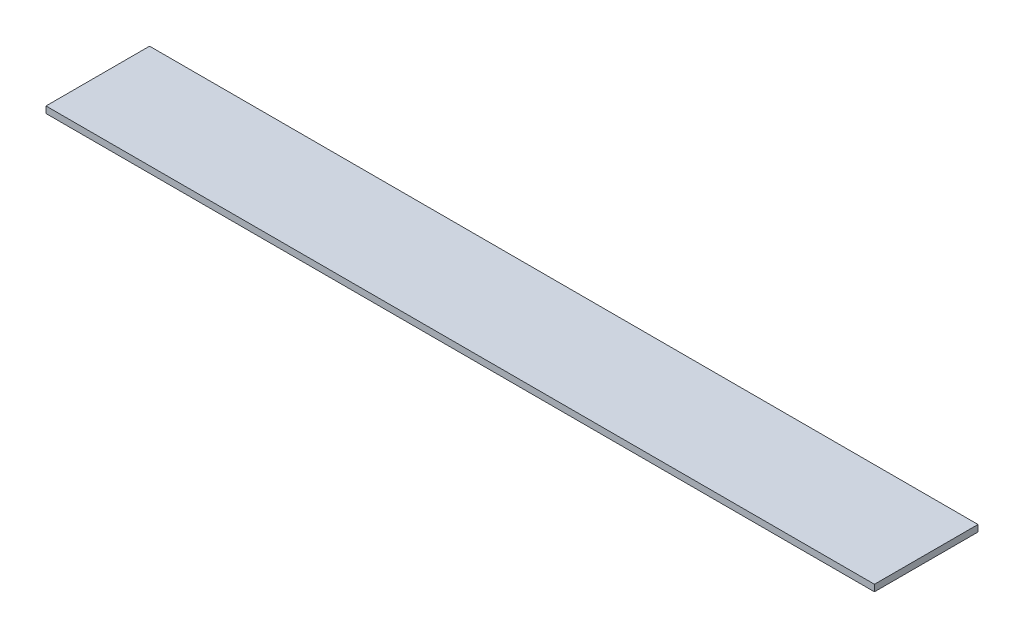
ISO-10303-21;
HEADER;
FILE_DESCRIPTION(('STEP AP214'),'2;1');
FILE_NAME('part.step','',(''),(''),'','','');
FILE_SCHEMA(('AUTOMOTIVE_DESIGN { 1 0 10303 214 1 1 1 1 }'));
ENDSEC;
DATA;
#1=APPLICATION_CONTEXT('core data for automotive mechanical design processes');
#2=APPLICATION_PROTOCOL_DEFINITION('international standard','automotive_design',2000,#1);
#3=PRODUCT_CONTEXT('',#1,'mechanical');
#4=PRODUCT('Part','Part','',(#3));
#5=PRODUCT_RELATED_PRODUCT_CATEGORY('part','',(#4));
#6=PRODUCT_DEFINITION_FORMATION('','',#4);
#7=PRODUCT_DEFINITION_CONTEXT('part definition',#1,'design');
#8=PRODUCT_DEFINITION('design','',#6,#7);
#9=PRODUCT_DEFINITION_SHAPE('','',#8);
#10=(LENGTH_UNIT() NAMED_UNIT(*) SI_UNIT(.MILLI.,.METRE.));
#11=(NAMED_UNIT(*) PLANE_ANGLE_UNIT() SI_UNIT($,.RADIAN.));
#12=(NAMED_UNIT(*) SI_UNIT($,.STERADIAN.) SOLID_ANGLE_UNIT());
#13=UNCERTAINTY_MEASURE_WITH_UNIT(LENGTH_MEASURE(1.E-05),#10,'distance_accuracy_value','');
#14=(GEOMETRIC_REPRESENTATION_CONTEXT(3) GLOBAL_UNCERTAINTY_ASSIGNED_CONTEXT((#13)) GLOBAL_UNIT_ASSIGNED_CONTEXT((#10,
#11,#12)) REPRESENTATION_CONTEXT('',''));
#15=CARTESIAN_POINT('',(0.,0.,0.));
#16=DIRECTION('',(0.,0.,1.));
#17=DIRECTION('',(1.,0.,0.));
#18=AXIS2_PLACEMENT_3D('',#15,#16,#17);
#19=CARTESIAN_POINT('',(0.,3.175,0.));
#20=DIRECTION('',(1.,0.,0.));
#21=DIRECTION('',(0.,0.,-1.));
#22=AXIS2_PLACEMENT_3D('',#19,#20,#21);
#23=PLANE('',#22);
#24=DIRECTION('',(0.,0.,1.));
#25=VECTOR('',#24,1.);
#26=CARTESIAN_POINT('',(0.,0.,0.));
#27=LINE('',#26,#25);
#28=CARTESIAN_POINT('',(0.,0.,-50.));
#29=VERTEX_POINT('',#28);
#30=CARTESIAN_POINT('',(0.,0.,0.));
#31=VERTEX_POINT('',#30);
#32=EDGE_CURVE('E96',#29,#31,#27,.T.);
#33=ORIENTED_EDGE('',*,*,#32,.T.);
#34=DIRECTION('',(0.,-1.,0.));
#35=VECTOR('',#34,1.);
#36=CARTESIAN_POINT('',(0.,3.175,0.));
#37=LINE('',#36,#35);
#38=CARTESIAN_POINT('',(0.,3.175,0.));
#39=VERTEX_POINT('',#38);
#40=EDGE_CURVE('E11',#39,#31,#37,.T.);
#41=ORIENTED_EDGE('',*,*,#40,.F.);
#42=DIRECTION('',(0.,0.,1.));
#43=VECTOR('',#42,1.);
#44=CARTESIAN_POINT('',(0.,3.175,0.));
#45=LINE('',#44,#43);
#46=CARTESIAN_POINT('',(0.,3.175,-50.));
#47=VERTEX_POINT('',#46);
#48=EDGE_CURVE('E84',#47,#39,#45,.T.);
#49=ORIENTED_EDGE('',*,*,#48,.F.);
#50=DIRECTION('',(0.,-1.,0.));
#51=VECTOR('',#50,1.);
#52=CARTESIAN_POINT('',(0.,3.175,-50.));
#53=LINE('',#52,#51);
#54=EDGE_CURVE('E92',#47,#29,#53,.T.);
#55=ORIENTED_EDGE('',*,*,#54,.T.);
#56=EDGE_LOOP('',(#33,#41,#49,#55));
#57=FACE_BOUND('',#56,.T.);
#58=ADVANCED_FACE('F33',(#57),#23,.F.);
#59=CARTESIAN_POINT('',(0.,3.175,0.));
#60=DIRECTION('',(0.,0.,-1.));
#61=DIRECTION('',(-1.,0.,0.));
#62=AXIS2_PLACEMENT_3D('',#59,#60,#61);
#63=PLANE('',#62);
#64=DIRECTION('',(1.,0.,0.));
#65=VECTOR('',#64,1.);
#66=CARTESIAN_POINT('',(0.,0.,0.));
#67=LINE('',#66,#65);
#68=CARTESIAN_POINT('',(400.,0.,0.));
#69=VERTEX_POINT('',#68);
#70=EDGE_CURVE('E88',#31,#69,#67,.T.);
#71=ORIENTED_EDGE('',*,*,#70,.T.);
#72=DIRECTION('',(0.,-1.,0.));
#73=VECTOR('',#72,1.);
#74=CARTESIAN_POINT('',(400.,3.175,0.));
#75=LINE('',#74,#73);
#76=CARTESIAN_POINT('',(400.,3.175,0.));
#77=VERTEX_POINT('',#76);
#78=EDGE_CURVE('E41',#77,#69,#75,.T.);
#79=ORIENTED_EDGE('',*,*,#78,.F.);
#80=DIRECTION('',(1.,0.,0.));
#81=VECTOR('',#80,1.);
#82=CARTESIAN_POINT('',(0.,3.175,0.));
#83=LINE('',#82,#81);
#84=EDGE_CURVE('E79',#39,#77,#83,.T.);
#85=ORIENTED_EDGE('',*,*,#84,.F.);
#86=ORIENTED_EDGE('',*,*,#40,.T.);
#87=EDGE_LOOP('',(#71,#79,#85,#86));
#88=FACE_BOUND('',#87,.T.);
#89=ADVANCED_FACE('F87',(#88),#63,.F.);
#90=CARTESIAN_POINT('',(400.,3.175,0.));
#91=DIRECTION('',(-1.,0.,0.));
#92=DIRECTION('',(0.,0.,1.));
#93=AXIS2_PLACEMENT_3D('',#90,#91,#92);
#94=PLANE('',#93);
#95=DIRECTION('',(0.,0.,-1.));
#96=VECTOR('',#95,1.);
#97=CARTESIAN_POINT('',(400.,0.,0.));
#98=LINE('',#97,#96);
#99=CARTESIAN_POINT('',(400.,0.,-50.));
#100=VERTEX_POINT('',#99);
#101=EDGE_CURVE('E66',#69,#100,#98,.T.);
#102=ORIENTED_EDGE('',*,*,#101,.T.);
#103=DIRECTION('',(0.,-1.,0.));
#104=VECTOR('',#103,1.);
#105=CARTESIAN_POINT('',(400.,3.175,-50.));
#106=LINE('',#105,#104);
#107=CARTESIAN_POINT('',(400.,3.175,-50.));
#108=VERTEX_POINT('',#107);
#109=EDGE_CURVE('E89',#108,#100,#106,.T.);
#110=ORIENTED_EDGE('',*,*,#109,.F.);
#111=DIRECTION('',(0.,0.,-1.));
#112=VECTOR('',#111,1.);
#113=CARTESIAN_POINT('',(400.,3.175,0.));
#114=LINE('',#113,#112);
#115=EDGE_CURVE('E82',#77,#108,#114,.T.);
#116=ORIENTED_EDGE('',*,*,#115,.F.);
#117=ORIENTED_EDGE('',*,*,#78,.T.);
#118=EDGE_LOOP('',(#102,#110,#116,#117));
#119=FACE_BOUND('',#118,.T.);
#120=ADVANCED_FACE('F90',(#119),#94,.F.);
#121=CARTESIAN_POINT('',(0.,3.175,-50.));
#122=DIRECTION('',(0.,0.,1.));
#123=DIRECTION('',(1.,0.,0.));
#124=AXIS2_PLACEMENT_3D('',#121,#122,#123);
#125=PLANE('',#124);
#126=DIRECTION('',(-1.,0.,0.));
#127=VECTOR('',#126,1.);
#128=CARTESIAN_POINT('',(0.,0.,-50.));
#129=LINE('',#128,#127);
#130=EDGE_CURVE('E72',#100,#29,#129,.T.);
#131=ORIENTED_EDGE('',*,*,#130,.T.);
#132=ORIENTED_EDGE('',*,*,#54,.F.);
#133=DIRECTION('',(-1.,0.,0.));
#134=VECTOR('',#133,1.);
#135=CARTESIAN_POINT('',(0.,3.175,-50.));
#136=LINE('',#135,#134);
#137=EDGE_CURVE('E49',#108,#47,#136,.T.);
#138=ORIENTED_EDGE('',*,*,#137,.F.);
#139=ORIENTED_EDGE('',*,*,#109,.T.);
#140=EDGE_LOOP('',(#131,#132,#138,#139));
#141=FACE_BOUND('',#140,.T.);
#142=ADVANCED_FACE('F103',(#141),#125,.F.);
#143=CARTESIAN_POINT('',(0.,3.175,0.));
#144=DIRECTION('',(0.,-1.,0.));
#145=DIRECTION('',(0.,0.,-1.));
#146=AXIS2_PLACEMENT_3D('',#143,#144,#145);
#147=PLANE('',#146);
#148=ORIENTED_EDGE('',*,*,#48,.T.);
#149=ORIENTED_EDGE('',*,*,#84,.T.);
#150=ORIENTED_EDGE('',*,*,#115,.T.);
#151=ORIENTED_EDGE('',*,*,#137,.T.);
#152=EDGE_LOOP('',(#148,#149,#150,#151));
#153=FACE_BOUND('',#152,.T.);
#154=ADVANCED_FACE('F80',(#153),#147,.F.);
#155=CARTESIAN_POINT('',(0.,0.,0.));
#156=DIRECTION('',(0.,-1.,0.));
#157=DIRECTION('',(0.,0.,-1.));
#158=AXIS2_PLACEMENT_3D('',#155,#156,#157);
#159=PLANE('',#158);
#160=ORIENTED_EDGE('',*,*,#32,.F.);
#161=ORIENTED_EDGE('',*,*,#130,.F.);
#162=ORIENTED_EDGE('',*,*,#101,.F.);
#163=ORIENTED_EDGE('',*,*,#70,.F.);
#164=EDGE_LOOP('',(#160,#161,#162,#163));
#165=FACE_BOUND('',#164,.T.);
#166=ADVANCED_FACE('F106',(#165),#159,.T.);
#167=CLOSED_SHELL('',(#58,#89,#120,#142,#154,#166));
#168=MANIFOLD_SOLID_BREP('B2',#167);
#169=ADVANCED_BREP_SHAPE_REPRESENTATION('',(#18,#168),#14);
#170=SHAPE_DEFINITION_REPRESENTATION(#9,#169);
ENDSEC;
END-ISO-10303-21;
